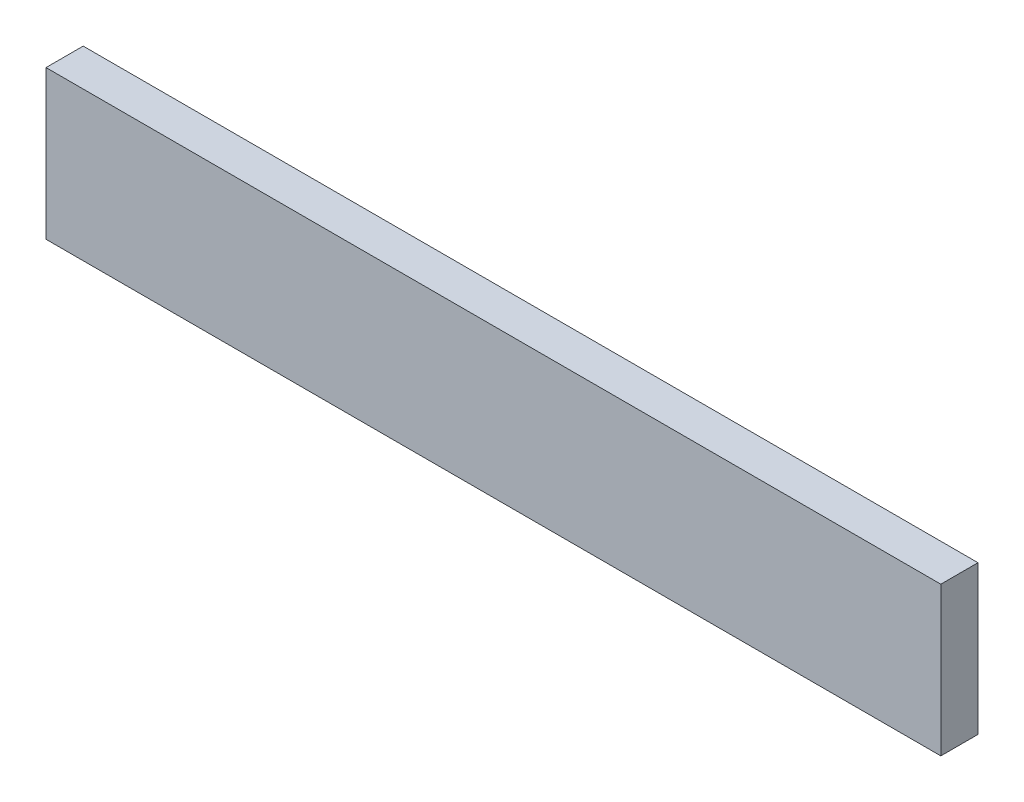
from build123d import *

# Parameters (mm, degrees)
ESQUISSE1_W        = 361
ESQUISSE1_H        = 60
BOSS_EXTRU_1_DEPTH = 15


with BuildPart() as part:
    # Esquisse1 → Boss.-Extru.1 (new body)
    with BuildSketch(Plane.XY):
        Rectangle(ESQUISSE1_W, ESQUISSE1_H)
    extrude(amount=BOSS_EXTRU_1_DEPTH)


solid = part.part
